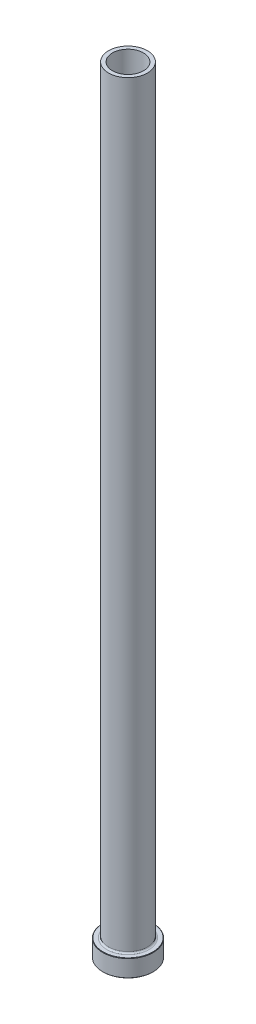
from build123d import *

# Parameters (mm, degrees)
FILLET1_R     = 0.8
CHAMFER1_SIZE = 0.2
CHAMFER3_SIZE = 0.5


with BuildPart() as part:
    # Sketch1 → Revolve1 (revolve)
    with BuildSketch(Plane.XY, mode=Mode.PRIVATE) as revolve1_sk:
        Polygon((-8, 400), (-10, 400), (-10, 9), (-13, 9), (-13, 0), (-8.25, 0), (-8.25, 333), (-8, 345), align=None)
    revolve(revolve1_sk.sketch.rotate(Axis((0, 92.187680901, 0), (0, -1, 0)), 270), axis=Axis((0, 92.187680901, 0), (0, -1, 0)))

    # Fillet1
    fillet1_edges = [part.edges().sort_by_distance(p)[0] for p in [
        (0, 9, -10),
    ]]
    fillet(fillet1_edges, radius=FILLET1_R)

    # Chamfer1
    chamfer1_edges = [part.edges().sort_by_distance(p)[0] for p in [
        (0, 0, -13),
        (0, 9, -13),
    ]]
    chamfer(chamfer1_edges, length=CHAMFER1_SIZE)

    # Chamfer3
    chamfer3_edges = [part.edges().sort_by_distance(p)[0] for p in [
        (0, 0, -8.25),
    ]]
    chamfer(chamfer3_edges, length=CHAMFER3_SIZE)


solid = part.part
